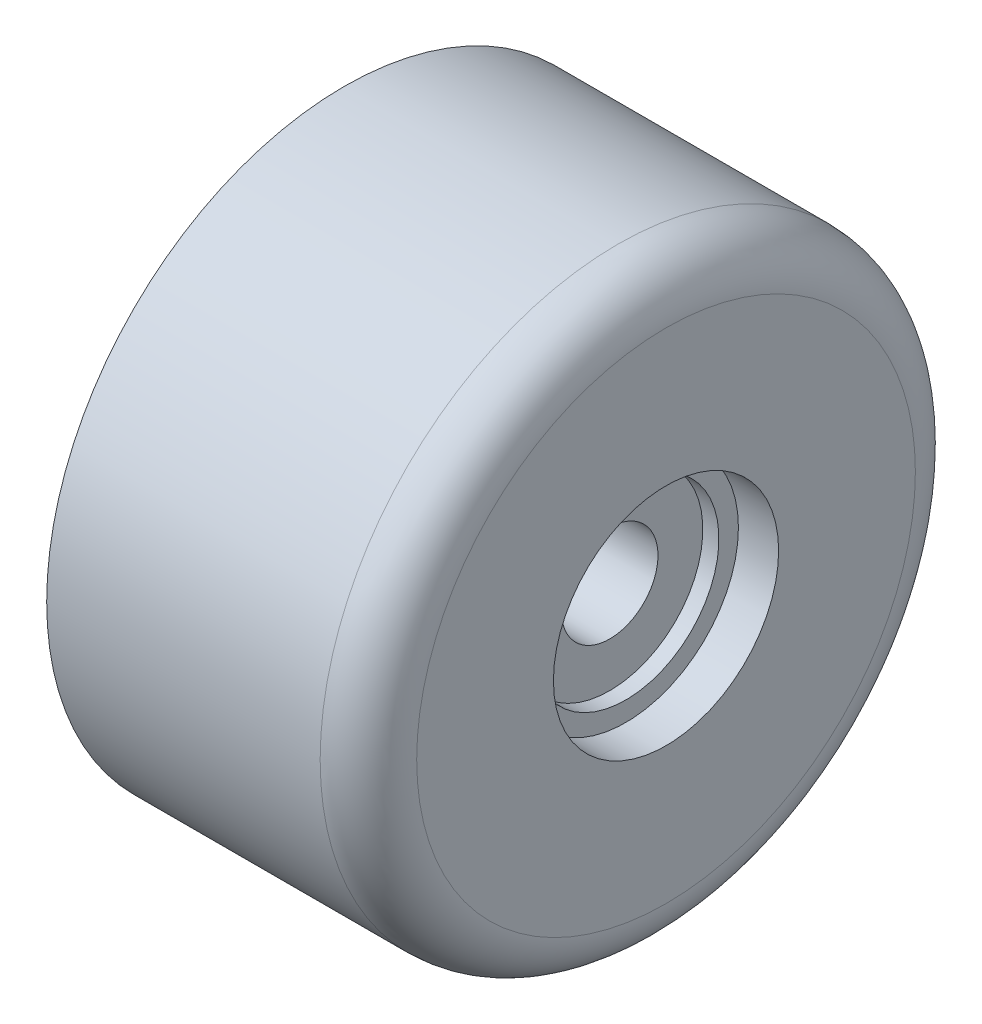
ISO-10303-21;
HEADER;
FILE_DESCRIPTION(('STEP AP214'),'2;1');
FILE_NAME('part.step','',(''),(''),'','','');
FILE_SCHEMA(('AUTOMOTIVE_DESIGN { 1 0 10303 214 1 1 1 1 }'));
ENDSEC;
DATA;
#1=APPLICATION_CONTEXT('core data for automotive mechanical design processes');
#2=APPLICATION_PROTOCOL_DEFINITION('international standard','automotive_design',2000,#1);
#3=PRODUCT_CONTEXT('',#1,'mechanical');
#4=PRODUCT('Part','Part','',(#3));
#5=PRODUCT_RELATED_PRODUCT_CATEGORY('part','',(#4));
#6=PRODUCT_DEFINITION_FORMATION('','',#4);
#7=PRODUCT_DEFINITION_CONTEXT('part definition',#1,'design');
#8=PRODUCT_DEFINITION('design','',#6,#7);
#9=PRODUCT_DEFINITION_SHAPE('','',#8);
#10=(LENGTH_UNIT() NAMED_UNIT(*) SI_UNIT(.MILLI.,.METRE.));
#11=(NAMED_UNIT(*) PLANE_ANGLE_UNIT() SI_UNIT($,.RADIAN.));
#12=(NAMED_UNIT(*) SI_UNIT($,.STERADIAN.) SOLID_ANGLE_UNIT());
#13=UNCERTAINTY_MEASURE_WITH_UNIT(LENGTH_MEASURE(1.E-05),#10,'distance_accuracy_value','');
#14=(GEOMETRIC_REPRESENTATION_CONTEXT(3) GLOBAL_UNCERTAINTY_ASSIGNED_CONTEXT((#13)) GLOBAL_UNIT_ASSIGNED_CONTEXT((#10,
#11,#12)) REPRESENTATION_CONTEXT('',''));
#15=CARTESIAN_POINT('',(0.,0.,0.));
#16=DIRECTION('',(0.,0.,1.));
#17=DIRECTION('',(1.,0.,0.));
#18=AXIS2_PLACEMENT_3D('',#15,#16,#17);
#19=CARTESIAN_POINT('',(0.,0.,0.));
#20=DIRECTION('',(-1.,0.,0.));
#21=DIRECTION('',(0.,0.,1.));
#22=AXIS2_PLACEMENT_3D('',#19,#20,#21);
#23=CYLINDRICAL_SURFACE('',#22,18.5);
#24=CARTESIAN_POINT('',(0.,0.,0.));
#25=DIRECTION('',(-1.,0.,0.));
#26=DIRECTION('',(0.,0.,1.));
#27=AXIS2_PLACEMENT_3D('',#24,#25,#26);
#28=CIRCLE('',#27,18.5);
#29=CARTESIAN_POINT('',(0.,0.,18.5));
#30=VERTEX_POINT('',#29);
#31=EDGE_CURVE('E91',#30,#30,#28,.T.);
#32=ORIENTED_EDGE('',*,*,#31,.F.);
#33=EDGE_LOOP('',(#32));
#34=FACE_BOUND('',#33,.T.);
#35=CARTESIAN_POINT('',(17.,0.,0.));
#36=DIRECTION('',(-1.,0.,0.));
#37=DIRECTION('',(0.,0.,1.));
#38=AXIS2_PLACEMENT_3D('',#35,#36,#37);
#39=CIRCLE('',#38,18.5);
#40=CARTESIAN_POINT('',(17.,0.,18.5));
#41=VERTEX_POINT('',#40);
#42=EDGE_CURVE('E10',#41,#41,#39,.T.);
#43=ORIENTED_EDGE('',*,*,#42,.T.);
#44=EDGE_LOOP('',(#43));
#45=FACE_BOUND('',#44,.T.);
#46=ADVANCED_FACE('F33',(#34,#45),#23,.T.);
#47=CARTESIAN_POINT('',(17.,0.,0.));
#48=DIRECTION('',(-1.,0.,0.));
#49=DIRECTION('',(0.,0.,1.));
#50=AXIS2_PLACEMENT_3D('',#47,#48,#49);
#51=TOROIDAL_SURFACE('',#50,15.5,3.);
#52=ORIENTED_EDGE('',*,*,#42,.F.);
#53=EDGE_LOOP('',(#52));
#54=FACE_BOUND('',#53,.T.);
#55=CARTESIAN_POINT('',(20.,0.,0.));
#56=DIRECTION('',(-1.,0.,0.));
#57=DIRECTION('',(0.,0.,1.));
#58=AXIS2_PLACEMENT_3D('',#55,#56,#57);
#59=CIRCLE('',#58,15.5);
#60=CARTESIAN_POINT('',(20.,0.,15.5));
#61=VERTEX_POINT('',#60);
#62=EDGE_CURVE('E39',#61,#61,#59,.T.);
#63=ORIENTED_EDGE('',*,*,#62,.T.);
#64=EDGE_LOOP('',(#63));
#65=FACE_BOUND('',#64,.T.);
#66=ADVANCED_FACE('F98',(#54,#65),#51,.T.);
#67=CARTESIAN_POINT('',(20.,15.5,0.));
#68=DIRECTION('',(-1.,0.,0.));
#69=DIRECTION('',(0.,0.,1.));
#70=AXIS2_PLACEMENT_3D('',#67,#68,#69);
#71=PLANE('',#70);
#72=ORIENTED_EDGE('',*,*,#62,.F.);
#73=EDGE_LOOP('',(#72));
#74=FACE_BOUND('',#73,.T.);
#75=CARTESIAN_POINT('',(20.,0.,0.));
#76=DIRECTION('',(-1.,0.,0.));
#77=DIRECTION('',(0.,0.,1.));
#78=AXIS2_PLACEMENT_3D('',#75,#76,#77);
#79=CIRCLE('',#78,7.);
#80=CARTESIAN_POINT('',(20.,0.,7.));
#81=VERTEX_POINT('',#80);
#82=EDGE_CURVE('E43',#81,#81,#79,.T.);
#83=ORIENTED_EDGE('',*,*,#82,.T.);
#84=EDGE_LOOP('',(#83));
#85=FACE_BOUND('',#84,.T.);
#86=ADVANCED_FACE('F102',(#74,#85),#71,.F.);
#87=CARTESIAN_POINT('',(0.,0.,0.));
#88=DIRECTION('',(-1.,0.,0.));
#89=DIRECTION('',(0.,0.,1.));
#90=AXIS2_PLACEMENT_3D('',#87,#88,#89);
#91=CYLINDRICAL_SURFACE('',#90,7.);
#92=ORIENTED_EDGE('',*,*,#82,.F.);
#93=EDGE_LOOP('',(#92));
#94=FACE_BOUND('',#93,.T.);
#95=CARTESIAN_POINT('',(17.5,0.,0.));
#96=DIRECTION('',(-1.,0.,0.));
#97=DIRECTION('',(0.,0.,1.));
#98=AXIS2_PLACEMENT_3D('',#95,#96,#97);
#99=CIRCLE('',#98,7.);
#100=CARTESIAN_POINT('',(17.5,0.,7.));
#101=VERTEX_POINT('',#100);
#102=EDGE_CURVE('E47',#101,#101,#99,.T.);
#103=ORIENTED_EDGE('',*,*,#102,.T.);
#104=EDGE_LOOP('',(#103));
#105=FACE_BOUND('',#104,.T.);
#106=ADVANCED_FACE('F107',(#94,#105),#91,.F.);
#107=CARTESIAN_POINT('',(17.5,7.,0.));
#108=DIRECTION('',(-1.,0.,0.));
#109=DIRECTION('',(0.,0.,1.));
#110=AXIS2_PLACEMENT_3D('',#107,#108,#109);
#111=PLANE('',#110);
#112=ORIENTED_EDGE('',*,*,#102,.F.);
#113=EDGE_LOOP('',(#112));
#114=FACE_BOUND('',#113,.T.);
#115=CARTESIAN_POINT('',(17.5,0.,0.));
#116=DIRECTION('',(-1.,0.,0.));
#117=DIRECTION('',(0.,0.,1.));
#118=AXIS2_PLACEMENT_3D('',#115,#116,#117);
#119=CIRCLE('',#118,5.78776548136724);
#120=CARTESIAN_POINT('',(17.5,0.,5.78776548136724));
#121=VERTEX_POINT('',#120);
#122=EDGE_CURVE('E52',#121,#121,#119,.T.);
#123=ORIENTED_EDGE('',*,*,#122,.T.);
#124=EDGE_LOOP('',(#123));
#125=FACE_BOUND('',#124,.T.);
#126=ADVANCED_FACE('F113',(#114,#125),#111,.F.);
#127=CARTESIAN_POINT('',(0.,0.,0.));
#128=DIRECTION('',(-1.,0.,0.));
#129=DIRECTION('',(0.,0.,1.));
#130=AXIS2_PLACEMENT_3D('',#127,#128,#129);
#131=CYLINDRICAL_SURFACE('',#130,5.78776548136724);
#132=ORIENTED_EDGE('',*,*,#122,.F.);
#133=EDGE_LOOP('',(#132));
#134=FACE_BOUND('',#133,.T.);
#135=CARTESIAN_POINT('',(16.5,0.,0.));
#136=DIRECTION('',(-1.,0.,0.));
#137=DIRECTION('',(0.,0.,1.));
#138=AXIS2_PLACEMENT_3D('',#135,#136,#137);
#139=CIRCLE('',#138,5.78776548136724);
#140=CARTESIAN_POINT('',(16.5,0.,5.78776548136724));
#141=VERTEX_POINT('',#140);
#142=EDGE_CURVE('E55',#141,#141,#139,.T.);
#143=ORIENTED_EDGE('',*,*,#142,.T.);
#144=EDGE_LOOP('',(#143));
#145=FACE_BOUND('',#144,.T.);
#146=ADVANCED_FACE('F117',(#134,#145),#131,.F.);
#147=CARTESIAN_POINT('',(16.5,5.78776548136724,0.));
#148=DIRECTION('',(-1.,0.,0.));
#149=DIRECTION('',(0.,0.,1.));
#150=AXIS2_PLACEMENT_3D('',#147,#148,#149);
#151=PLANE('',#150);
#152=ORIENTED_EDGE('',*,*,#142,.F.);
#153=EDGE_LOOP('',(#152));
#154=FACE_BOUND('',#153,.T.);
#155=CARTESIAN_POINT('',(16.5,0.,0.));
#156=DIRECTION('',(-1.,0.,0.));
#157=DIRECTION('',(0.,0.,1.));
#158=AXIS2_PLACEMENT_3D('',#155,#156,#157);
#159=CIRCLE('',#158,3.);
#160=CARTESIAN_POINT('',(16.5,0.,3.));
#161=VERTEX_POINT('',#160);
#162=EDGE_CURVE('E58',#161,#161,#159,.T.);
#163=ORIENTED_EDGE('',*,*,#162,.T.);
#164=EDGE_LOOP('',(#163));
#165=FACE_BOUND('',#164,.T.);
#166=ADVANCED_FACE('F121',(#154,#165),#151,.F.);
#167=CARTESIAN_POINT('',(0.,0.,0.));
#168=DIRECTION('',(-1.,0.,0.));
#169=DIRECTION('',(0.,0.,1.));
#170=AXIS2_PLACEMENT_3D('',#167,#168,#169);
#171=CYLINDRICAL_SURFACE('',#170,3.);
#172=ORIENTED_EDGE('',*,*,#162,.F.);
#173=EDGE_LOOP('',(#172));
#174=FACE_BOUND('',#173,.T.);
#175=CARTESIAN_POINT('',(0.,0.,0.));
#176=DIRECTION('',(-1.,0.,0.));
#177=DIRECTION('',(0.,0.,1.));
#178=AXIS2_PLACEMENT_3D('',#175,#176,#177);
#179=CIRCLE('',#178,3.);
#180=CARTESIAN_POINT('',(0.,0.,3.));
#181=VERTEX_POINT('',#180);
#182=EDGE_CURVE('E61',#181,#181,#179,.T.);
#183=ORIENTED_EDGE('',*,*,#182,.T.);
#184=EDGE_LOOP('',(#183));
#185=FACE_BOUND('',#184,.T.);
#186=ADVANCED_FACE('F125',(#174,#185),#171,.F.);
#187=CARTESIAN_POINT('',(0.,3.54534578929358,0.));
#188=DIRECTION('',(1.,0.,0.));
#189=DIRECTION('',(0.,0.,-1.));
#190=AXIS2_PLACEMENT_3D('',#187,#188,#189);
#191=PLANE('',#190);
#192=ORIENTED_EDGE('',*,*,#182,.F.);
#193=EDGE_LOOP('',(#192));
#194=FACE_BOUND('',#193,.T.);
#195=CARTESIAN_POINT('',(0.,0.,0.));
#196=DIRECTION('',(-1.,0.,0.));
#197=DIRECTION('',(0.,0.,1.));
#198=AXIS2_PLACEMENT_3D('',#195,#196,#197);
#199=CIRCLE('',#198,3.54534578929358);
#200=CARTESIAN_POINT('',(0.,0.,3.54534578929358));
#201=VERTEX_POINT('',#200);
#202=EDGE_CURVE('E64',#201,#201,#199,.T.);
#203=ORIENTED_EDGE('',*,*,#202,.T.);
#204=EDGE_LOOP('',(#203));
#205=FACE_BOUND('',#204,.T.);
#206=ADVANCED_FACE('F129',(#194,#205),#191,.F.);
#207=CARTESIAN_POINT('',(0.,0.,0.));
#208=DIRECTION('',(-1.,0.,0.));
#209=DIRECTION('',(0.,0.,1.));
#210=AXIS2_PLACEMENT_3D('',#207,#208,#209);
#211=CYLINDRICAL_SURFACE('',#210,3.54534578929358);
#212=ORIENTED_EDGE('',*,*,#202,.F.);
#213=EDGE_LOOP('',(#212));
#214=FACE_BOUND('',#213,.T.);
#215=CARTESIAN_POINT('',(15.5680580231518,0.,0.));
#216=DIRECTION('',(-1.,0.,0.));
#217=DIRECTION('',(0.,0.,1.));
#218=AXIS2_PLACEMENT_3D('',#215,#216,#217);
#219=CIRCLE('',#218,3.54534578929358);
#220=CARTESIAN_POINT('',(15.5680580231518,0.,3.54534578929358));
#221=VERTEX_POINT('',#220);
#222=EDGE_CURVE('E67',#221,#221,#219,.T.);
#223=ORIENTED_EDGE('',*,*,#222,.T.);
#224=EDGE_LOOP('',(#223));
#225=FACE_BOUND('',#224,.T.);
#226=ADVANCED_FACE('F133',(#214,#225),#211,.T.);
#227=CARTESIAN_POINT('',(15.5680580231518,6.41400241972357,0.));
#228=DIRECTION('',(1.,0.,0.));
#229=DIRECTION('',(0.,0.,-1.));
#230=AXIS2_PLACEMENT_3D('',#227,#228,#229);
#231=PLANE('',#230);
#232=ORIENTED_EDGE('',*,*,#222,.F.);
#233=EDGE_LOOP('',(#232));
#234=FACE_BOUND('',#233,.T.);
#235=CARTESIAN_POINT('',(15.5680580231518,0.,0.));
#236=DIRECTION('',(-1.,0.,0.));
#237=DIRECTION('',(0.,0.,1.));
#238=AXIS2_PLACEMENT_3D('',#235,#236,#237);
#239=CIRCLE('',#238,6.41400241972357);
#240=CARTESIAN_POINT('',(15.5680580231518,0.,6.41400241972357));
#241=VERTEX_POINT('',#240);
#242=EDGE_CURVE('E70',#241,#241,#239,.T.);
#243=ORIENTED_EDGE('',*,*,#242,.T.);
#244=EDGE_LOOP('',(#243));
#245=FACE_BOUND('',#244,.T.);
#246=ADVANCED_FACE('F137',(#234,#245),#231,.F.);
#247=CARTESIAN_POINT('',(0.,0.,0.));
#248=DIRECTION('',(-1.,0.,0.));
#249=DIRECTION('',(0.,0.,1.));
#250=AXIS2_PLACEMENT_3D('',#247,#248,#249);
#251=CYLINDRICAL_SURFACE('',#250,6.41400241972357);
#252=ORIENTED_EDGE('',*,*,#242,.F.);
#253=EDGE_LOOP('',(#252));
#254=FACE_BOUND('',#253,.T.);
#255=CARTESIAN_POINT('',(17.,0.,0.));
#256=DIRECTION('',(-1.,0.,0.));
#257=DIRECTION('',(0.,0.,1.));
#258=AXIS2_PLACEMENT_3D('',#255,#256,#257);
#259=CIRCLE('',#258,6.41400241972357);
#260=CARTESIAN_POINT('',(17.,0.,6.41400241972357));
#261=VERTEX_POINT('',#260);
#262=EDGE_CURVE('E73',#261,#261,#259,.T.);
#263=ORIENTED_EDGE('',*,*,#262,.T.);
#264=EDGE_LOOP('',(#263));
#265=FACE_BOUND('',#264,.T.);
#266=ADVANCED_FACE('F141',(#254,#265),#251,.T.);
#267=CARTESIAN_POINT('',(17.,7.61573695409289,0.));
#268=DIRECTION('',(1.,0.,0.));
#269=DIRECTION('',(0.,0.,-1.));
#270=AXIS2_PLACEMENT_3D('',#267,#268,#269);
#271=PLANE('',#270);
#272=ORIENTED_EDGE('',*,*,#262,.F.);
#273=EDGE_LOOP('',(#272));
#274=FACE_BOUND('',#273,.T.);
#275=CARTESIAN_POINT('',(17.,0.,0.));
#276=DIRECTION('',(-1.,0.,0.));
#277=DIRECTION('',(0.,0.,1.));
#278=AXIS2_PLACEMENT_3D('',#275,#276,#277);
#279=CIRCLE('',#278,7.61573695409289);
#280=CARTESIAN_POINT('',(17.,0.,7.61573695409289));
#281=VERTEX_POINT('',#280);
#282=EDGE_CURVE('E76',#281,#281,#279,.T.);
#283=ORIENTED_EDGE('',*,*,#282,.T.);
#284=EDGE_LOOP('',(#283));
#285=FACE_BOUND('',#284,.T.);
#286=ADVANCED_FACE('F145',(#274,#285),#271,.F.);
#287=CARTESIAN_POINT('',(0.,0.,0.));
#288=DIRECTION('',(-1.,0.,0.));
#289=DIRECTION('',(0.,0.,1.));
#290=AXIS2_PLACEMENT_3D('',#287,#288,#289);
#291=CYLINDRICAL_SURFACE('',#290,7.61573695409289);
#292=ORIENTED_EDGE('',*,*,#282,.F.);
#293=EDGE_LOOP('',(#292));
#294=FACE_BOUND('',#293,.T.);
#295=CARTESIAN_POINT('',(18.3591833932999,0.,0.));
#296=DIRECTION('',(-1.,0.,0.));
#297=DIRECTION('',(0.,0.,1.));
#298=AXIS2_PLACEMENT_3D('',#295,#296,#297);
#299=CIRCLE('',#298,7.61573695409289);
#300=CARTESIAN_POINT('',(18.3591833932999,0.,7.61573695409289));
#301=VERTEX_POINT('',#300);
#302=EDGE_CURVE('E79',#301,#301,#299,.T.);
#303=ORIENTED_EDGE('',*,*,#302,.T.);
#304=EDGE_LOOP('',(#303));
#305=FACE_BOUND('',#304,.T.);
#306=ADVANCED_FACE('F149',(#294,#305),#291,.T.);
#307=CARTESIAN_POINT('',(18.3591833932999,15.5,0.));
#308=DIRECTION('',(1.,0.,0.));
#309=DIRECTION('',(0.,0.,-1.));
#310=AXIS2_PLACEMENT_3D('',#307,#308,#309);
#311=PLANE('',#310);
#312=ORIENTED_EDGE('',*,*,#302,.F.);
#313=EDGE_LOOP('',(#312));
#314=FACE_BOUND('',#313,.T.);
#315=CARTESIAN_POINT('',(18.3591833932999,0.,0.));
#316=DIRECTION('',(-1.,0.,0.));
#317=DIRECTION('',(0.,0.,1.));
#318=AXIS2_PLACEMENT_3D('',#315,#316,#317);
#319=CIRCLE('',#318,15.5);
#320=CARTESIAN_POINT('',(18.3591833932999,0.,15.5));
#321=VERTEX_POINT('',#320);
#322=EDGE_CURVE('E82',#321,#321,#319,.T.);
#323=ORIENTED_EDGE('',*,*,#322,.T.);
#324=EDGE_LOOP('',(#323));
#325=FACE_BOUND('',#324,.T.);
#326=ADVANCED_FACE('F153',(#314,#325),#311,.F.);
#327=CARTESIAN_POINT('',(17.5,0.,0.));
#328=DIRECTION('',(-1.,0.,0.));
#329=DIRECTION('',(0.,0.,1.));
#330=AXIS2_PLACEMENT_3D('',#327,#328,#329);
#331=CONICAL_SURFACE('',#330,17.1133163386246,1.08144337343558);
#332=ORIENTED_EDGE('',*,*,#322,.F.);
#333=EDGE_LOOP('',(#332));
#334=FACE_BOUND('',#333,.T.);
#335=CARTESIAN_POINT('',(17.5,0.,0.));
#336=DIRECTION('',(-1.,0.,0.));
#337=DIRECTION('',(0.,0.,1.));
#338=AXIS2_PLACEMENT_3D('',#335,#336,#337);
#339=CIRCLE('',#338,17.1133163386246);
#340=CARTESIAN_POINT('',(17.5,0.,17.1133163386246));
#341=VERTEX_POINT('',#340);
#342=EDGE_CURVE('E85',#341,#341,#339,.T.);
#343=ORIENTED_EDGE('',*,*,#342,.T.);
#344=EDGE_LOOP('',(#343));
#345=FACE_BOUND('',#344,.T.);
#346=ADVANCED_FACE('F157',(#334,#345),#331,.F.);
#347=CARTESIAN_POINT('',(0.,0.,0.));
#348=DIRECTION('',(-1.,0.,0.));
#349=DIRECTION('',(0.,0.,1.));
#350=AXIS2_PLACEMENT_3D('',#347,#348,#349);
#351=CYLINDRICAL_SURFACE('',#350,17.1133163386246);
#352=ORIENTED_EDGE('',*,*,#342,.F.);
#353=EDGE_LOOP('',(#352));
#354=FACE_BOUND('',#353,.T.);
#355=CARTESIAN_POINT('',(0.,0.,0.));
#356=DIRECTION('',(-1.,0.,0.));
#357=DIRECTION('',(0.,0.,1.));
#358=AXIS2_PLACEMENT_3D('',#355,#356,#357);
#359=CIRCLE('',#358,17.1133163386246);
#360=CARTESIAN_POINT('',(0.,0.,17.1133163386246));
#361=VERTEX_POINT('',#360);
#362=EDGE_CURVE('E88',#361,#361,#359,.T.);
#363=ORIENTED_EDGE('',*,*,#362,.T.);
#364=EDGE_LOOP('',(#363));
#365=FACE_BOUND('',#364,.T.);
#366=ADVANCED_FACE('F161',(#354,#365),#351,.F.);
#367=CARTESIAN_POINT('',(0.,18.5,0.));
#368=DIRECTION('',(1.,0.,0.));
#369=DIRECTION('',(0.,0.,-1.));
#370=AXIS2_PLACEMENT_3D('',#367,#368,#369);
#371=PLANE('',#370);
#372=ORIENTED_EDGE('',*,*,#362,.F.);
#373=EDGE_LOOP('',(#372));
#374=FACE_BOUND('',#373,.T.);
#375=ORIENTED_EDGE('',*,*,#31,.T.);
#376=EDGE_LOOP('',(#375));
#377=FACE_BOUND('',#376,.T.);
#378=ADVANCED_FACE('F95',(#374,#377),#371,.F.);
#379=CLOSED_SHELL('',(#46,#66,#86,#106,#126,#146,#166,#186,#206,#226,#246,#266,#286,#306,#326,
#346,#366,#378));
#380=MANIFOLD_SOLID_BREP('B2',#379);
#381=ADVANCED_BREP_SHAPE_REPRESENTATION('',(#18,#380),#14);
#382=SHAPE_DEFINITION_REPRESENTATION(#9,#381);
ENDSEC;
END-ISO-10303-21;
